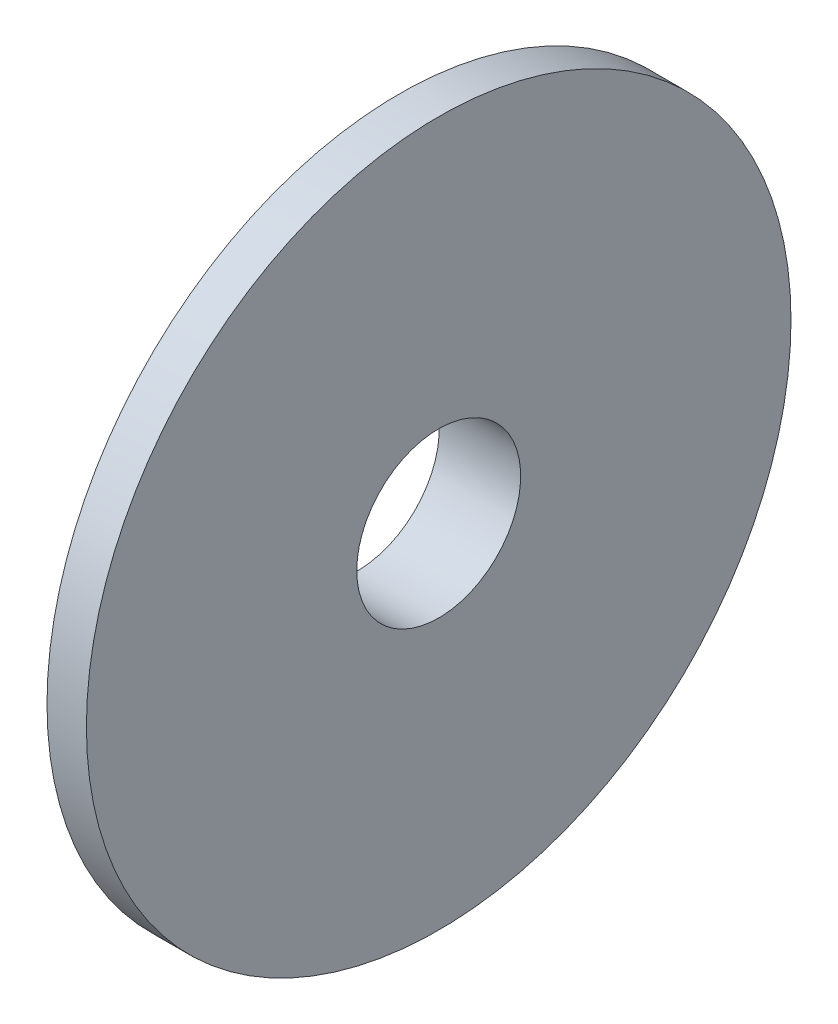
from build123d import *


with BuildPart() as part:
    # Esquisse1 → R_volution1 (revolve)
    with BuildSketch(Plane.XY, mode=Mode.PRIVATE) as r_volution1_sk:
        Polygon((0, 5.2), (0, 10), (2.665, 22.35), (5.165, 22.35), (5.165, 5.2), align=None)
    revolve(r_volution1_sk.sketch.rotate(Axis((0, 0, 0), (1, 0, 0)), 90), axis=Axis((0, 0, 0), (1, 0, 0)))


solid = part.part
